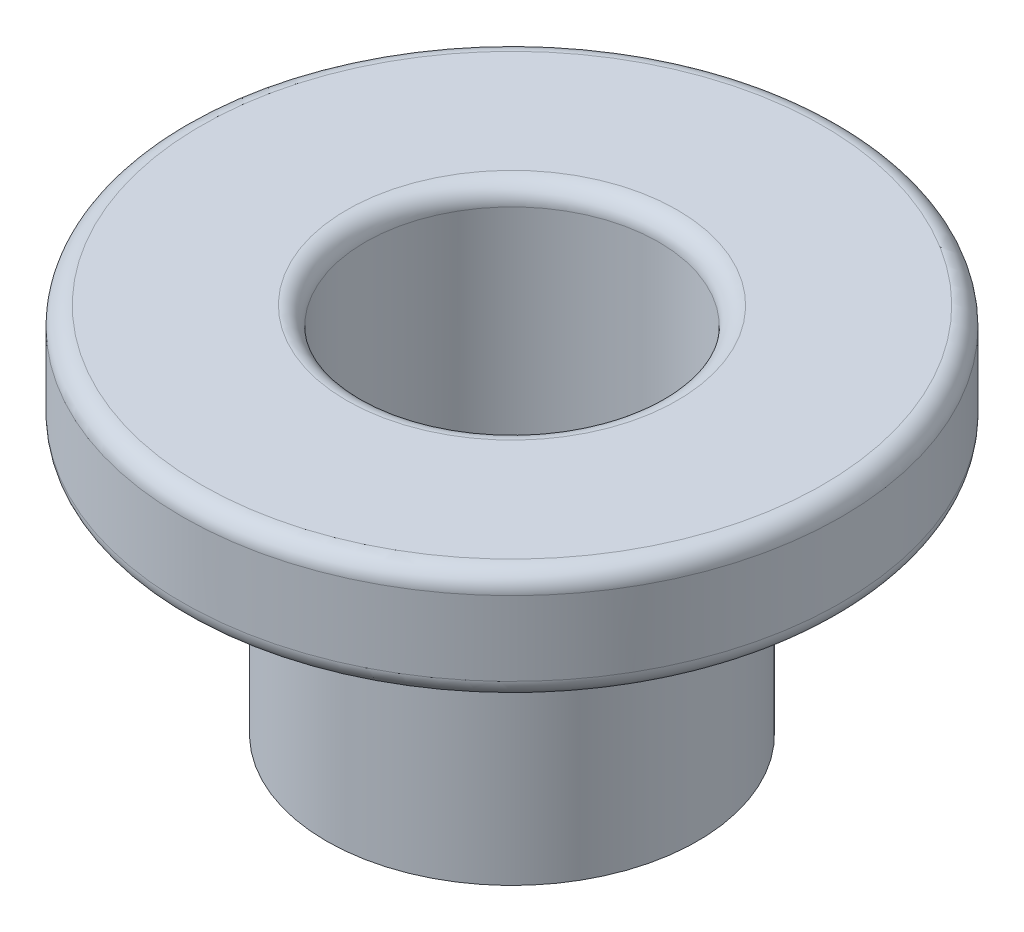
ISO-10303-21;
HEADER;
FILE_DESCRIPTION(('STEP AP214'),'2;1');
FILE_NAME('part.step','',(''),(''),'','','');
FILE_SCHEMA(('AUTOMOTIVE_DESIGN { 1 0 10303 214 1 1 1 1 }'));
ENDSEC;
DATA;
#1=APPLICATION_CONTEXT('core data for automotive mechanical design processes');
#2=APPLICATION_PROTOCOL_DEFINITION('international standard','automotive_design',2000,#1);
#3=PRODUCT_CONTEXT('',#1,'mechanical');
#4=PRODUCT('Part','Part','',(#3));
#5=PRODUCT_RELATED_PRODUCT_CATEGORY('part','',(#4));
#6=PRODUCT_DEFINITION_FORMATION('','',#4);
#7=PRODUCT_DEFINITION_CONTEXT('part definition',#1,'design');
#8=PRODUCT_DEFINITION('design','',#6,#7);
#9=PRODUCT_DEFINITION_SHAPE('','',#8);
#10=(LENGTH_UNIT() NAMED_UNIT(*) SI_UNIT(.MILLI.,.METRE.));
#11=(NAMED_UNIT(*) PLANE_ANGLE_UNIT() SI_UNIT($,.RADIAN.));
#12=(NAMED_UNIT(*) SI_UNIT($,.STERADIAN.) SOLID_ANGLE_UNIT());
#13=UNCERTAINTY_MEASURE_WITH_UNIT(LENGTH_MEASURE(1.E-05),#10,'distance_accuracy_value','');
#14=(GEOMETRIC_REPRESENTATION_CONTEXT(3) GLOBAL_UNCERTAINTY_ASSIGNED_CONTEXT((#13)) GLOBAL_UNIT_ASSIGNED_CONTEXT((#10,
#11,#12)) REPRESENTATION_CONTEXT('',''));
#15=CARTESIAN_POINT('',(0.,0.,0.));
#16=DIRECTION('',(0.,0.,1.));
#17=DIRECTION('',(1.,0.,0.));
#18=AXIS2_PLACEMENT_3D('',#15,#16,#17);
#19=CARTESIAN_POINT('',(2.54,0.,0.));
#20=DIRECTION('',(0.,-1.,0.));
#21=DIRECTION('',(0.,0.,-1.));
#22=AXIS2_PLACEMENT_3D('',#19,#20,#21);
#23=PLANE('',#22);
#24=CARTESIAN_POINT('',(0.,0.,0.));
#25=DIRECTION('',(0.,-1.,0.));
#26=DIRECTION('',(0.,0.,-1.));
#27=AXIS2_PLACEMENT_3D('',#24,#25,#26);
#28=CIRCLE('',#27,2.54);
#29=CARTESIAN_POINT('',(0.,0.,-2.54));
#30=VERTEX_POINT('',#29);
#31=EDGE_CURVE('E55',#30,#30,#28,.T.);
#32=ORIENTED_EDGE('',*,*,#31,.T.);
#33=EDGE_LOOP('',(#32));
#34=FACE_BOUND('',#33,.T.);
#35=CARTESIAN_POINT('',(0.,0.,0.));
#36=DIRECTION('',(0.,-1.,0.));
#37=DIRECTION('',(0.,0.,-1.));
#38=AXIS2_PLACEMENT_3D('',#35,#36,#37);
#39=CIRCLE('',#38,2.0066);
#40=CARTESIAN_POINT('',(0.,0.,-2.0066));
#41=VERTEX_POINT('',#40);
#42=EDGE_CURVE('E49',#41,#41,#39,.T.);
#43=ORIENTED_EDGE('',*,*,#42,.F.);
#44=EDGE_LOOP('',(#43));
#45=FACE_BOUND('',#44,.T.);
#46=ADVANCED_FACE('F24',(#34,#45),#23,.T.);
#47=CARTESIAN_POINT('',(0.,0.,0.));
#48=DIRECTION('',(0.,-1.,0.));
#49=DIRECTION('',(0.,0.,-1.));
#50=AXIS2_PLACEMENT_3D('',#47,#48,#49);
#51=CYLINDRICAL_SURFACE('',#50,2.0066);
#52=CARTESIAN_POINT('',(0.,4.826,0.));
#53=DIRECTION('',(0.,1.,0.));
#54=DIRECTION('',(0.,0.,1.));
#55=AXIS2_PLACEMENT_3D('',#52,#53,#54);
#56=CIRCLE('',#55,2.0066);
#57=CARTESIAN_POINT('',(0.,4.826,2.0066));
#58=VERTEX_POINT('',#57);
#59=EDGE_CURVE('E38',#58,#58,#56,.T.);
#60=ORIENTED_EDGE('',*,*,#59,.T.);
#61=EDGE_LOOP('',(#60));
#62=FACE_BOUND('',#61,.T.);
#63=ORIENTED_EDGE('',*,*,#42,.T.);
#64=EDGE_LOOP('',(#63));
#65=FACE_BOUND('',#64,.T.);
#66=ADVANCED_FACE('F79',(#62,#65),#51,.F.);
#67=CARTESIAN_POINT('',(2.0066,5.08,0.));
#68=DIRECTION('',(0.,1.,0.));
#69=DIRECTION('',(0.,0.,1.));
#70=AXIS2_PLACEMENT_3D('',#67,#68,#69);
#71=PLANE('',#70);
#72=CARTESIAN_POINT('',(0.,5.08,0.));
#73=DIRECTION('',(0.,1.,0.));
#74=DIRECTION('',(0.,0.,1.));
#75=AXIS2_PLACEMENT_3D('',#72,#73,#74);
#76=CIRCLE('',#75,2.2606);
#77=CARTESIAN_POINT('',(0.,5.08,2.2606));
#78=VERTEX_POINT('',#77);
#79=EDGE_CURVE('E43',#78,#78,#76,.F.);
#80=ORIENTED_EDGE('',*,*,#79,.T.);
#81=EDGE_LOOP('',(#80));
#82=FACE_BOUND('',#81,.T.);
#83=CARTESIAN_POINT('',(0.,5.08,0.));
#84=DIRECTION('',(0.,1.,0.));
#85=DIRECTION('',(0.,0.,1.));
#86=AXIS2_PLACEMENT_3D('',#83,#84,#85);
#87=CIRCLE('',#86,4.2545);
#88=CARTESIAN_POINT('',(0.,5.08,4.2545));
#89=VERTEX_POINT('',#88);
#90=EDGE_CURVE('E46',#89,#89,#87,.T.);
#91=ORIENTED_EDGE('',*,*,#90,.T.);
#92=EDGE_LOOP('',(#91));
#93=FACE_BOUND('',#92,.T.);
#94=ADVANCED_FACE('F82',(#82,#93),#71,.T.);
#95=CARTESIAN_POINT('',(0.,0.,0.));
#96=DIRECTION('',(0.,-1.,0.));
#97=DIRECTION('',(0.,0.,-1.));
#98=AXIS2_PLACEMENT_3D('',#95,#96,#97);
#99=CYLINDRICAL_SURFACE('',#98,4.5085);
#100=CARTESIAN_POINT('',(0.,3.81,0.));
#101=DIRECTION('',(0.,-1.,0.));
#102=DIRECTION('',(0.,0.,-1.));
#103=AXIS2_PLACEMENT_3D('',#100,#101,#102);
#104=CIRCLE('',#103,4.5085);
#105=CARTESIAN_POINT('',(0.,3.81,-4.5085));
#106=VERTEX_POINT('',#105);
#107=EDGE_CURVE('E10',#106,#106,#104,.F.);
#108=ORIENTED_EDGE('',*,*,#107,.T.);
#109=EDGE_LOOP('',(#108));
#110=FACE_BOUND('',#109,.T.);
#111=CARTESIAN_POINT('',(0.,4.826,0.));
#112=DIRECTION('',(0.,1.,0.));
#113=DIRECTION('',(0.,0.,1.));
#114=AXIS2_PLACEMENT_3D('',#111,#112,#113);
#115=CIRCLE('',#114,4.5085);
#116=CARTESIAN_POINT('',(0.,4.826,4.5085));
#117=VERTEX_POINT('',#116);
#118=EDGE_CURVE('E30',#117,#117,#115,.F.);
#119=ORIENTED_EDGE('',*,*,#118,.T.);
#120=EDGE_LOOP('',(#119));
#121=FACE_BOUND('',#120,.T.);
#122=ADVANCED_FACE('F76',(#110,#121),#99,.T.);
#123=CARTESIAN_POINT('',(4.5085,3.556,0.));
#124=DIRECTION('',(0.,-1.,0.));
#125=DIRECTION('',(0.,0.,-1.));
#126=AXIS2_PLACEMENT_3D('',#123,#124,#125);
#127=PLANE('',#126);
#128=CARTESIAN_POINT('',(0.,3.556,0.));
#129=DIRECTION('',(0.,-1.,0.));
#130=DIRECTION('',(0.,0.,-1.));
#131=AXIS2_PLACEMENT_3D('',#128,#129,#130);
#132=CIRCLE('',#131,4.2545);
#133=CARTESIAN_POINT('',(0.,3.556,-4.2545));
#134=VERTEX_POINT('',#133);
#135=EDGE_CURVE('E34',#134,#134,#132,.T.);
#136=ORIENTED_EDGE('',*,*,#135,.T.);
#137=EDGE_LOOP('',(#136));
#138=FACE_BOUND('',#137,.T.);
#139=CARTESIAN_POINT('',(0.,3.556,0.));
#140=DIRECTION('',(0.,-1.,0.));
#141=DIRECTION('',(0.,0.,-1.));
#142=AXIS2_PLACEMENT_3D('',#139,#140,#141);
#143=CIRCLE('',#142,2.54);
#144=CARTESIAN_POINT('',(0.,3.556,-2.54));
#145=VERTEX_POINT('',#144);
#146=EDGE_CURVE('E52',#145,#145,#143,.T.);
#147=ORIENTED_EDGE('',*,*,#146,.F.);
#148=EDGE_LOOP('',(#147));
#149=FACE_BOUND('',#148,.T.);
#150=ADVANCED_FACE('F64',(#138,#149),#127,.T.);
#151=CARTESIAN_POINT('',(0.,0.,0.));
#152=DIRECTION('',(0.,-1.,0.));
#153=DIRECTION('',(0.,0.,-1.));
#154=AXIS2_PLACEMENT_3D('',#151,#152,#153);
#155=CYLINDRICAL_SURFACE('',#154,2.54);
#156=ORIENTED_EDGE('',*,*,#146,.T.);
#157=EDGE_LOOP('',(#156));
#158=FACE_BOUND('',#157,.T.);
#159=ORIENTED_EDGE('',*,*,#31,.F.);
#160=EDGE_LOOP('',(#159));
#161=FACE_BOUND('',#160,.T.);
#162=ADVANCED_FACE('F61',(#158,#161),#155,.T.);
#163=CARTESIAN_POINT('',(0.,4.826,0.));
#164=DIRECTION('',(0.,1.,0.));
#165=DIRECTION('',(0.,0.,1.));
#166=AXIS2_PLACEMENT_3D('',#163,#164,#165);
#167=TOROIDAL_SURFACE('',#166,2.2606,0.254);
#168=ORIENTED_EDGE('',*,*,#59,.F.);
#169=EDGE_LOOP('',(#168));
#170=FACE_BOUND('',#169,.T.);
#171=ORIENTED_EDGE('',*,*,#79,.F.);
#172=EDGE_LOOP('',(#171));
#173=FACE_BOUND('',#172,.T.);
#174=ADVANCED_FACE('F63',(#170,#173),#167,.T.);
#175=CARTESIAN_POINT('',(0.,3.81,0.));
#176=DIRECTION('',(0.,-1.,0.));
#177=DIRECTION('',(0.,0.,-1.));
#178=AXIS2_PLACEMENT_3D('',#175,#176,#177);
#179=TOROIDAL_SURFACE('',#178,4.2545,0.254);
#180=ORIENTED_EDGE('',*,*,#107,.F.);
#181=EDGE_LOOP('',(#180));
#182=FACE_BOUND('',#181,.T.);
#183=ORIENTED_EDGE('',*,*,#135,.F.);
#184=EDGE_LOOP('',(#183));
#185=FACE_BOUND('',#184,.T.);
#186=ADVANCED_FACE('F72',(#182,#185),#179,.T.);
#187=CARTESIAN_POINT('',(0.,4.826,0.));
#188=DIRECTION('',(0.,1.,0.));
#189=DIRECTION('',(0.,0.,1.));
#190=AXIS2_PLACEMENT_3D('',#187,#188,#189);
#191=TOROIDAL_SURFACE('',#190,4.2545,0.254);
#192=ORIENTED_EDGE('',*,*,#90,.F.);
#193=EDGE_LOOP('',(#192));
#194=FACE_BOUND('',#193,.T.);
#195=ORIENTED_EDGE('',*,*,#118,.F.);
#196=EDGE_LOOP('',(#195));
#197=FACE_BOUND('',#196,.T.);
#198=ADVANCED_FACE('F110',(#194,#197),#191,.T.);
#199=CLOSED_SHELL('',(#46,#66,#94,#122,#150,#162,#174,#186,#198));
#200=MANIFOLD_SOLID_BREP('B2',#199);
#201=ADVANCED_BREP_SHAPE_REPRESENTATION('',(#18,#200),#14);
#202=SHAPE_DEFINITION_REPRESENTATION(#9,#201);
ENDSEC;
END-ISO-10303-21;
